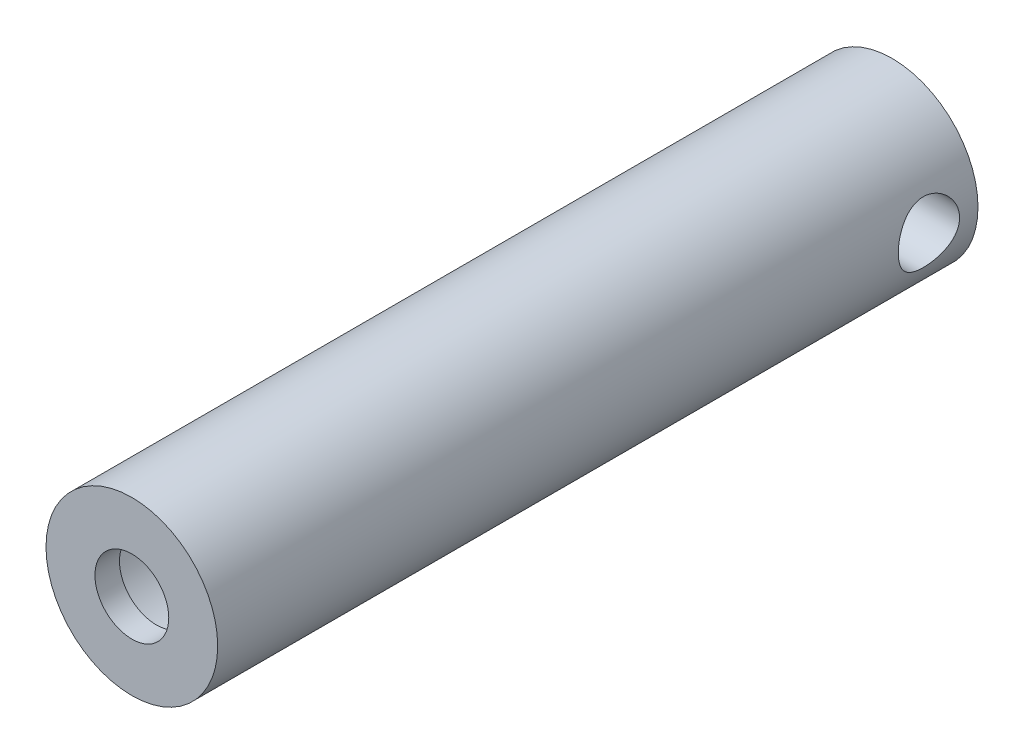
ISO-10303-21;
HEADER;
FILE_DESCRIPTION(('STEP AP214'),'2;1');
FILE_NAME('part.step','',(''),(''),'','','');
FILE_SCHEMA(('AUTOMOTIVE_DESIGN { 1 0 10303 214 1 1 1 1 }'));
ENDSEC;
DATA;
#1=APPLICATION_CONTEXT('core data for automotive mechanical design processes');
#2=APPLICATION_PROTOCOL_DEFINITION('international standard','automotive_design',2000,#1);
#3=PRODUCT_CONTEXT('',#1,'mechanical');
#4=PRODUCT('Part','Part','',(#3));
#5=PRODUCT_RELATED_PRODUCT_CATEGORY('part','',(#4));
#6=PRODUCT_DEFINITION_FORMATION('','',#4);
#7=PRODUCT_DEFINITION_CONTEXT('part definition',#1,'design');
#8=PRODUCT_DEFINITION('design','',#6,#7);
#9=PRODUCT_DEFINITION_SHAPE('','',#8);
#10=(LENGTH_UNIT() NAMED_UNIT(*) SI_UNIT(.MILLI.,.METRE.));
#11=(NAMED_UNIT(*) PLANE_ANGLE_UNIT() SI_UNIT($,.RADIAN.));
#12=(NAMED_UNIT(*) SI_UNIT($,.STERADIAN.) SOLID_ANGLE_UNIT());
#13=UNCERTAINTY_MEASURE_WITH_UNIT(LENGTH_MEASURE(1.E-05),#10,'distance_accuracy_value','');
#14=(GEOMETRIC_REPRESENTATION_CONTEXT(3) GLOBAL_UNCERTAINTY_ASSIGNED_CONTEXT((#13)) GLOBAL_UNIT_ASSIGNED_CONTEXT((#10,
#11,#12)) REPRESENTATION_CONTEXT('',''));
#15=CARTESIAN_POINT('',(0.,0.,0.));
#16=DIRECTION('',(0.,0.,1.));
#17=DIRECTION('',(1.,0.,0.));
#18=AXIS2_PLACEMENT_3D('',#15,#16,#17);
#19=CARTESIAN_POINT('',(0.,0.,50.));
#20=DIRECTION('',(0.,0.,-1.));
#21=DIRECTION('',(-1.,0.,0.));
#22=AXIS2_PLACEMENT_3D('',#19,#20,#21);
#23=CYLINDRICAL_SURFACE('',#22,35.);
#24=CARTESIAN_POINT('',(0.,-35.,22.75));
#25=CARTESIAN_POINT('',(-0.154213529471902,-34.9999985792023,22.7499932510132));
#26=CARTESIAN_POINT('',(-0.308532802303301,-34.9989699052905,22.7369844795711));
#27=CARTESIAN_POINT('',(-0.612903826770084,-34.9949652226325,22.6852802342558));
#28=CARTESIAN_POINT('',(-0.762950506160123,-34.9919869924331,22.6465554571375));
#29=CARTESIAN_POINT('',(-1.05432390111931,-34.9844198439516,22.5445440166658));
#30=CARTESIAN_POINT('',(-1.19565541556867,-34.97983182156,22.4812710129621));
#31=CARTESIAN_POINT('',(-1.46565723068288,-34.9695599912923,22.3319830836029));
#32=CARTESIAN_POINT('',(-1.59433027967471,-34.9638764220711,22.2459731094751));
#33=CARTESIAN_POINT('',(-1.83569091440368,-34.9520370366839,22.053440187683));
#34=CARTESIAN_POINT('',(-1.94834565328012,-34.9458802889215,21.9468761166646));
#35=CARTESIAN_POINT('',(-2.15419016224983,-34.9337962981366,21.7163464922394));
#36=CARTESIAN_POINT('',(-2.24737908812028,-34.9278690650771,21.5923801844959));
#37=CARTESIAN_POINT('',(-2.41175601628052,-34.9169049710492,21.3303685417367));
#38=CARTESIAN_POINT('',(-2.4829154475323,-34.9118692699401,21.1923052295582));
#39=CARTESIAN_POINT('',(-2.60103087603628,-34.9032687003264,20.9061441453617));
#40=CARTESIAN_POINT('',(-2.6479872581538,-34.8997038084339,20.7580465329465));
#41=CARTESIAN_POINT('',(-2.71626915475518,-34.894456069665,20.4563476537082));
#42=CARTESIAN_POINT('',(-2.73764781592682,-34.8927693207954,20.3027584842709));
#43=CARTESIAN_POINT('',(-2.75433156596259,-34.8914564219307,19.9941631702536));
#44=CARTESIAN_POINT('',(-2.7496370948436,-34.891830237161,19.8391570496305));
#45=CARTESIAN_POINT('',(-2.71435180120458,-34.8945926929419,19.5324915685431));
#46=CARTESIAN_POINT('',(-2.68381867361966,-34.8969768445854,19.3808255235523));
#47=CARTESIAN_POINT('',(-2.59781238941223,-34.9034842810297,19.0847777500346));
#48=CARTESIAN_POINT('',(-2.54233901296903,-34.9076075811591,18.9403960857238));
#49=CARTESIAN_POINT('',(-2.40796208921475,-34.917133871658,18.6628312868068));
#50=CARTESIAN_POINT('',(-2.32903258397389,-34.9225382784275,18.5296607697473));
#51=CARTESIAN_POINT('',(-2.15000265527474,-34.9340164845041,18.2784364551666));
#52=CARTESIAN_POINT('',(-2.0499018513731,-34.9400902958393,18.1603829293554));
#53=CARTESIAN_POINT('',(-1.83104688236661,-34.9522428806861,17.9424081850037));
#54=CARTESIAN_POINT('',(-1.71224282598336,-34.9583216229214,17.8425370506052));
#55=CARTESIAN_POINT('',(-1.45952803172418,-34.9697833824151,17.6641490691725));
#56=CARTESIAN_POINT('',(-1.32561728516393,-34.9751663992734,17.5856322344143));
#57=CARTESIAN_POINT('',(-1.04645833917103,-34.9846310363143,17.452185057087));
#58=CARTESIAN_POINT('',(-0.901209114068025,-34.9887125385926,17.3972568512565));
#59=CARTESIAN_POINT('',(-0.603510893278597,-34.9951128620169,17.3125807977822));
#60=CARTESIAN_POINT('',(-0.451062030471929,-34.9974317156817,17.2828324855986));
#61=CARTESIAN_POINT('',(-0.143726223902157,-35.0000412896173,17.2494232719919));
#62=CARTESIAN_POINT('',(0.0111531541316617,-35.0003373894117,17.2456931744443));
#63=CARTESIAN_POINT('',(0.319335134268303,-34.9988824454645,17.2642451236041));
#64=CARTESIAN_POINT('',(0.472637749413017,-34.9971314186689,17.2865269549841));
#65=CARTESIAN_POINT('',(0.773117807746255,-34.9917826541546,17.3564129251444));
#66=CARTESIAN_POINT('',(0.920302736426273,-34.9881872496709,17.4039850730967));
#67=CARTESIAN_POINT('',(1.20460104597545,-34.9795537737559,17.5230686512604));
#68=CARTESIAN_POINT('',(1.3417142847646,-34.9745156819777,17.594580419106));
#69=CARTESIAN_POINT('',(1.60229247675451,-34.9635485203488,17.7596877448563));
#70=CARTESIAN_POINT('',(1.72572824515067,-34.9576176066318,17.8533292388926));
#71=CARTESIAN_POINT('',(1.95515321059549,-34.9455376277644,18.0599713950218));
#72=CARTESIAN_POINT('',(2.06114213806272,-34.9393885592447,18.1729723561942));
#73=CARTESIAN_POINT('',(2.252901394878,-34.9275494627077,18.4154255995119));
#74=CARTESIAN_POINT('',(2.33862663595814,-34.9218604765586,18.5449136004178));
#75=CARTESIAN_POINT('',(2.48711613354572,-34.9116000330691,18.816487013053));
#76=CARTESIAN_POINT('',(2.54988059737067,-34.9070285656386,18.9585723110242));
#77=CARTESIAN_POINT('',(2.65058975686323,-34.8995263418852,19.2511461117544));
#78=CARTESIAN_POINT('',(2.68856225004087,-34.8965937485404,19.4016249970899));
#79=CARTESIAN_POINT('',(2.73870014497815,-34.892694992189,19.7068465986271));
#80=CARTESIAN_POINT('',(2.75086598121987,-34.8917287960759,19.8615892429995));
#81=CARTESIAN_POINT('',(2.74904043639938,-34.8918726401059,20.1704976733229));
#82=CARTESIAN_POINT('',(2.73511990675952,-34.8929770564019,20.3246638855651));
#83=CARTESIAN_POINT('',(2.68166431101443,-34.8971257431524,20.628461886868));
#84=CARTESIAN_POINT('',(2.64212920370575,-34.9001700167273,20.7780936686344));
#85=CARTESIAN_POINT('',(2.53858420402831,-34.9078539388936,21.0685813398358));
#86=CARTESIAN_POINT('',(2.47457536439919,-34.9124935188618,21.2094376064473));
#87=CARTESIAN_POINT('',(2.32390811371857,-34.9228453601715,21.4784158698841));
#88=CARTESIAN_POINT('',(2.23725011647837,-34.9285576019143,21.6065380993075));
#89=CARTESIAN_POINT('',(2.04347868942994,-34.9404295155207,21.8467735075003));
#90=CARTESIAN_POINT('',(1.93631298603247,-34.946590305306,21.9588444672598));
#91=CARTESIAN_POINT('',(1.70465914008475,-34.9586550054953,22.163451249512));
#92=CARTESIAN_POINT('',(1.58016680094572,-34.9645588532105,22.2559823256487));
#93=CARTESIAN_POINT('',(1.31717895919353,-34.9754539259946,22.4189922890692));
#94=CARTESIAN_POINT('',(1.17866000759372,-34.9804435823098,22.4894334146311));
#95=CARTESIAN_POINT('',(0.891817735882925,-34.9889291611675,22.6059686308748));
#96=CARTESIAN_POINT('',(0.743505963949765,-34.9924268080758,22.652090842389));
#97=CARTESIAN_POINT('',(0.495259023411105,-34.9966316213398,22.7068711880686));
#98=CARTESIAN_POINT('',(0.396922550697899,-34.9978890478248,22.7230231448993));
#99=CARTESIAN_POINT('',(0.19907207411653,-34.9995736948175,22.7445897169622));
#100=CARTESIAN_POINT('',(0.0995580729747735,-35.0000009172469,22.7500043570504));
#101=CARTESIAN_POINT('',(0.,-35.,22.75));
#102=B_SPLINE_CURVE_WITH_KNOTS('',3,(#24,#25,#26,#27,#28,#29,#30,#31,#32,#33,#34,#35,#36,#37,
#38,#39,#40,#41,#42,#43,#44,#45,#46,#47,#48,#49,#50,#51,#52,#53,#54,#55,#56,#57,#58,#59,#60,#61,
#62,#63,#64,#65,#66,#67,#68,#69,#70,#71,#72,#73,#74,#75,#76,#77,#78,#79,#80,#81,#82,#83,#84,#85,
#86,#87,#88,#89,#90,#91,#92,#93,#94,#95,#96,#97,#98,#99,#100,#101),.UNSPECIFIED.,.T.,.F.,(4,2,2,
2,2,2,2,2,2,2,2,2,2,2,2,2,2,2,2,2,2,2,2,2,2,2,2,2,2,2,2,2,2,2,2,2,2,2,4),(0.,0.462277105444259,
0.92508187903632,1.38762949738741,1.85007646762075,2.31345845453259,2.77686053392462,
3.24086112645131,3.70485434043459,4.16788176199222,4.6309013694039,5.09288982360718,
5.554882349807,6.01738806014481,6.47990208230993,6.94367145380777,7.40744109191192,
7.87125273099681,8.33505581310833,8.79762492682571,9.26019021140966,9.72217176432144,
10.1841598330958,10.6471154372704,11.1100781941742,11.5740615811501,12.0380407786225,
12.5014988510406,12.964949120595,13.4271424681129,13.889336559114,14.3515107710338,
14.8136765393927,15.2770364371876,15.7405087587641,16.2047690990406,16.6684914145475,
16.9669316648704,17.2653712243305),.UNSPECIFIED.);
#103=CARTESIAN_POINT('',(0.,-35.,22.75));
#104=VERTEX_POINT('',#103);
#105=EDGE_CURVE('E57',#104,#104,#102,.T.);
#106=ORIENTED_EDGE('',*,*,#105,.F.);
#107=EDGE_LOOP('',(#106));
#108=FACE_BOUND('',#107,.T.);
#109=CARTESIAN_POINT('',(-35.,0.,32.5));
#110=CARTESIAN_POINT('',(-35.0000006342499,-0.339590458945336,32.5000008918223));
#111=CARTESIAN_POINT('',(-34.9950467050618,-0.679167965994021,32.4861506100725));
#112=CARTESIAN_POINT('',(-34.9753685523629,-1.35577397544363,32.4308919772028));
#113=CARTESIAN_POINT('',(-34.9606448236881,-1.69280260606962,32.3894850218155));
#114=CARTESIAN_POINT('',(-34.9218277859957,-2.36182709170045,32.2795234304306));
#115=CARTESIAN_POINT('',(-34.8977349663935,-2.69382320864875,32.2109702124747));
#116=CARTESIAN_POINT('',(-34.8408248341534,-3.35045317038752,32.0473628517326));
#117=CARTESIAN_POINT('',(-34.8080073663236,-3.67508688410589,31.9523082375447));
#118=CARTESIAN_POINT('',(-34.7345800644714,-4.31418928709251,31.7367497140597));
#119=CARTESIAN_POINT('',(-34.6939849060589,-4.62867583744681,31.6162936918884));
#120=CARTESIAN_POINT('',(-34.6060051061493,-5.24610944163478,31.3508266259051));
#121=CARTESIAN_POINT('',(-34.5586205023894,-5.54905655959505,31.2058157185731));
#122=CARTESIAN_POINT('',(-34.4582529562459,-6.14158833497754,30.8923475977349));
#123=CARTESIAN_POINT('',(-34.4052699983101,-6.43117295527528,30.7238903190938));
#124=CARTESIAN_POINT('',(-34.2949948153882,-6.99542804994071,30.3646465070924));
#125=CARTESIAN_POINT('',(-34.2377009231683,-7.27009268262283,30.1738513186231));
#126=CARTESIAN_POINT('',(-34.1181762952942,-7.81215317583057,29.7642026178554));
#127=CARTESIAN_POINT('',(-34.0558431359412,-8.07896326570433,29.5446036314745));
#128=CARTESIAN_POINT('',(-33.9296805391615,-8.59342620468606,29.0841759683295));
#129=CARTESIAN_POINT('',(-33.8658504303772,-8.84107023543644,28.8433376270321));
#130=CARTESIAN_POINT('',(-33.7383843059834,-9.3156763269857,28.3419047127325));
#131=CARTESIAN_POINT('',(-33.6747483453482,-9.54263297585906,28.0813050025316));
#132=CARTESIAN_POINT('',(-33.5494227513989,-9.97430378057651,27.5420486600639));
#133=CARTESIAN_POINT('',(-33.4877322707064,-10.1790277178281,27.2634000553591));
#134=CARTESIAN_POINT('',(-33.3659068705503,-10.5716586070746,26.6796683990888));
#135=CARTESIAN_POINT('',(-33.3058985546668,-10.7587443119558,26.3740056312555));
#136=CARTESIAN_POINT('',(-33.1916181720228,-11.106302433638,25.7470393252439));
#137=CARTESIAN_POINT('',(-33.1373437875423,-11.266785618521,25.4257421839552));
#138=CARTESIAN_POINT('',(-33.0362462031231,-11.5598652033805,24.76955144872));
#139=CARTESIAN_POINT('',(-32.9894225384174,-11.6924633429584,24.4346587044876));
#140=CARTESIAN_POINT('',(-32.9047991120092,-11.9285347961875,23.7536528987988));
#141=CARTESIAN_POINT('',(-32.8669988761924,-12.0320096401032,23.4075404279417));
#142=CARTESIAN_POINT('',(-32.8029840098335,-12.2054275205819,22.7200061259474));
#143=CARTESIAN_POINT('',(-32.7763849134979,-12.2764918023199,22.3789028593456));
#144=CARTESIAN_POINT('',(-32.7336648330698,-12.3899506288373,21.6913081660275));
#145=CARTESIAN_POINT('',(-32.7175436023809,-12.4323458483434,21.3448168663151));
#146=CARTESIAN_POINT('',(-32.6963417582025,-12.487999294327,20.6492738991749));
#147=CARTESIAN_POINT('',(-32.6912576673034,-12.5012666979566,20.3002230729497));
#148=CARTESIAN_POINT('',(-32.6922992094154,-12.4985431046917,19.6022585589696));
#149=CARTESIAN_POINT('',(-32.6984244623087,-12.4825530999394,19.2533448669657));
#150=CARTESIAN_POINT('',(-32.7210431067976,-12.4231343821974,18.5770750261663));
#151=CARTESIAN_POINT('',(-32.7369636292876,-12.3812211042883,18.2495651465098));
#152=CARTESIAN_POINT('',(-32.7781529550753,-12.271760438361,17.5994709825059));
#153=CARTESIAN_POINT('',(-32.8034213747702,-12.2042141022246,17.2768864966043));
#154=CARTESIAN_POINT('',(-32.8625456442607,-12.0441007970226,16.6387709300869));
#155=CARTESIAN_POINT('',(-32.8964023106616,-11.9515314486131,16.3232405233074));
#156=CARTESIAN_POINT('',(-32.9717131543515,-11.742167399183,15.7012573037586));
#157=CARTESIAN_POINT('',(-33.0131675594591,-11.6253719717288,15.3948047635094));
#158=CARTESIAN_POINT('',(-33.1032939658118,-11.3662247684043,14.787531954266));
#159=CARTESIAN_POINT('',(-33.1520797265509,-11.2234609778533,14.4869045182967));
#160=CARTESIAN_POINT('',(-33.2549746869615,-10.9148118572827,13.8985840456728));
#161=CARTESIAN_POINT('',(-33.3090858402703,-10.7489180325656,13.6108958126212));
#162=CARTESIAN_POINT('',(-33.4211784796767,-10.3951549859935,13.0501321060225));
#163=CARTESIAN_POINT('',(-33.4791602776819,-10.2072839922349,12.7770578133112));
#164=CARTESIAN_POINT('',(-33.59750351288,-9.8107372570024,12.2470006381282));
#165=CARTESIAN_POINT('',(-33.6578650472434,-9.60206066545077,11.9900184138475));
#166=CARTESIAN_POINT('',(-33.7831643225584,-9.15181214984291,11.4784160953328));
#167=CARTESIAN_POINT('',(-33.8481571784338,-8.90901163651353,11.2248893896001));
#168=CARTESIAN_POINT('',(-33.977323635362,-8.40295394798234,10.7391507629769));
#169=CARTESIAN_POINT('',(-34.0414975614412,-8.13970520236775,10.5069301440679));
#170=CARTESIAN_POINT('',(-34.1673566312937,-7.59408676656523,10.0650542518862));
#171=CARTESIAN_POINT('',(-34.2290403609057,-7.31170644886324,9.85541169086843));
#172=CARTESIAN_POINT('',(-34.348189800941,-6.72978575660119,9.46037943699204));
#173=CARTESIAN_POINT('',(-34.4056572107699,-6.43025238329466,9.27497994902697));
#174=CARTESIAN_POINT('',(-34.5155541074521,-5.81175099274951,8.92746572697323));
#175=CARTESIAN_POINT('',(-34.56790751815,-5.49257940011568,8.76568877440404));
#176=CARTESIAN_POINT('',(-34.6652188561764,-4.84058141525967,8.46973814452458));
#177=CARTESIAN_POINT('',(-34.7101766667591,-4.50775480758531,8.33556490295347));
#178=CARTESIAN_POINT('',(-34.7913777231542,-3.83094638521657,8.09610756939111));
#179=CARTESIAN_POINT('',(-34.8276238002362,-3.48696823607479,7.99081409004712));
#180=CARTESIAN_POINT('',(-34.8903430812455,-2.79037944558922,7.81011762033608));
#181=CARTESIAN_POINT('',(-34.9168168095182,-2.43776926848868,7.73471302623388));
#182=CARTESIAN_POINT('',(-34.9581567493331,-1.74414077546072,7.61752970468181));
#183=CARTESIAN_POINT('',(-34.9735274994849,-1.40339938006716,7.5742862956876));
#184=CARTESIAN_POINT('',(-34.9942830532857,-0.71921373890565,7.5159864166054));
#185=CARTESIAN_POINT('',(-34.9996681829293,-0.375769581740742,7.50092902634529));
#186=CARTESIAN_POINT('',(-35.0003019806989,0.311139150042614,7.49915451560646));
#187=CARTESIAN_POINT('',(-34.9955524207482,0.654603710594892,7.51243244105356));
#188=CARTESIAN_POINT('',(-34.9760531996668,1.33898774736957,7.56718246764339));
#189=CARTESIAN_POINT('',(-34.9613036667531,1.67990725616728,7.60865420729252));
#190=CARTESIAN_POINT('',(-34.9228854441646,2.34504554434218,7.71747516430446));
#191=CARTESIAN_POINT('',(-34.8995393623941,2.66943652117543,7.7838899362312));
#192=CARTESIAN_POINT('',(-34.8445023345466,3.31125305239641,7.94202198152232));
#193=CARTESIAN_POINT('',(-34.8128116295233,3.62867880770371,8.03373852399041));
#194=CARTESIAN_POINT('',(-34.7418777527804,4.25454293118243,8.24170004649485));
#195=CARTESIAN_POINT('',(-34.7026339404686,4.56298053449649,8.35794710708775));
#196=CARTESIAN_POINT('',(-34.6175608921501,5.16895598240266,8.61403926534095));
#197=CARTESIAN_POINT('',(-34.5717314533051,5.46649349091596,8.75388508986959));
#198=CARTESIAN_POINT('',(-34.4732318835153,6.05709563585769,9.06037674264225));
#199=CARTESIAN_POINT('',(-34.4204061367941,6.34980172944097,9.2276633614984));
#200=CARTESIAN_POINT('',(-34.3102670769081,6.92026080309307,9.58494792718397));
#201=CARTESIAN_POINT('',(-34.2529520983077,7.19800816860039,9.77495431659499));
#202=CARTESIAN_POINT('',(-34.1352645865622,7.73691127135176,10.1764003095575));
#203=CARTESIAN_POINT('',(-34.0748917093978,7.99806513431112,10.3878423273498));
#204=CARTESIAN_POINT('',(-33.9525838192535,8.5023158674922,10.8308524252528));
#205=CARTESIAN_POINT('',(-33.8906487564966,8.74541216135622,11.0624211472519));
#206=CARTESIAN_POINT('',(-33.7634823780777,9.22452672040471,11.5570837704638));
#207=CARTESIAN_POINT('',(-33.6982496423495,9.45949398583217,11.8211965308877));
#208=CARTESIAN_POINT('',(-33.5696121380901,9.90632052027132,12.3685147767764));
#209=CARTESIAN_POINT('',(-33.5062065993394,10.1181896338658,12.6517120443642));
#210=CARTESIAN_POINT('',(-33.3829855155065,10.5176039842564,13.2357395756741));
#211=CARTESIAN_POINT('',(-33.323171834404,10.7051366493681,13.5365788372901));
#212=CARTESIAN_POINT('',(-33.2089834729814,11.0542822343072,14.1537627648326));
#213=CARTESIAN_POINT('',(-33.154606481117,11.2159061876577,14.4701007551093));
#214=CARTESIAN_POINT('',(-33.052892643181,11.5122054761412,15.1167853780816));
#215=CARTESIAN_POINT('',(-33.0055653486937,11.6468443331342,15.447150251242));
#216=CARTESIAN_POINT('',(-32.9195919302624,11.8876757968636,16.1192050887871));
#217=CARTESIAN_POINT('',(-32.8809458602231,11.9938682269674,16.4608951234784));
#218=CARTESIAN_POINT('',(-32.8136778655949,12.1767009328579,17.1529020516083));
#219=CARTESIAN_POINT('',(-32.7850513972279,12.2533546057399,17.5032149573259));
#220=CARTESIAN_POINT('',(-32.7388216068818,12.3763442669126,18.2098358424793));
#221=CARTESIAN_POINT('',(-32.7212176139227,12.4226821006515,18.5661434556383));
#222=CARTESIAN_POINT('',(-32.6983652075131,12.4827026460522,19.2607819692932));
#223=CARTESIAN_POINT('',(-32.6924521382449,12.4981426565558,19.5989402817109));
#224=CARTESIAN_POINT('',(-32.6911527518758,12.5015415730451,20.2754077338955));
#225=CARTESIAN_POINT('',(-32.6957660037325,12.4895016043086,20.6137168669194));
#226=CARTESIAN_POINT('',(-32.7153660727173,12.4380694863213,21.2879138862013));
#227=CARTESIAN_POINT('',(-32.730352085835,12.3986794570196,21.623801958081));
#228=CARTESIAN_POINT('',(-32.770208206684,12.2929507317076,22.2907093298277));
#229=CARTESIAN_POINT('',(-32.7950783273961,12.2266120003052,22.6217286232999));
#230=CARTESIAN_POINT('',(-32.8531695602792,12.0696336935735,23.2683067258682));
#231=CARTESIAN_POINT('',(-32.8861648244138,11.9796475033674,23.584044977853));
#232=CARTESIAN_POINT('',(-32.9598295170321,11.7754578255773,24.2066527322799));
#233=CARTESIAN_POINT('',(-33.0004987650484,11.6612549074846,24.5135224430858));
#234=CARTESIAN_POINT('',(-33.0883705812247,11.409535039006,25.1165684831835));
#235=CARTESIAN_POINT('',(-33.1355731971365,11.272017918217,25.4127447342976));
#236=CARTESIAN_POINT('',(-33.2352604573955,10.9746096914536,25.992848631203));
#237=CARTESIAN_POINT('',(-33.2877471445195,10.8147099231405,26.2767714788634));
#238=CARTESIAN_POINT('',(-33.399267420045,10.4653784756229,26.8441311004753));
#239=CARTESIAN_POINT('',(-33.4584948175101,10.2748930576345,27.1268812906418));
#240=CARTESIAN_POINT('',(-33.5796636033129,9.87170257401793,27.6756416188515));
#241=CARTESIAN_POINT('',(-33.6416062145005,9.65898743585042,27.9416440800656));
#242=CARTESIAN_POINT('',(-33.7665636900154,9.21264816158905,28.4553486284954));
#243=CARTESIAN_POINT('',(-33.8295788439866,8.9790183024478,28.7030456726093));
#244=CARTESIAN_POINT('',(-33.9550122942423,8.49236413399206,29.1785313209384));
#245=CARTESIAN_POINT('',(-34.0174308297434,8.23934799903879,29.4063282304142));
#246=CARTESIAN_POINT('',(-34.1430408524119,7.70274291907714,29.8511378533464));
#247=CARTESIAN_POINT('',(-34.2061270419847,7.41827115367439,30.0671169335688));
#248=CARTESIAN_POINT('',(-34.328149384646,6.8313939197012,30.4742327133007));
#249=CARTESIAN_POINT('',(-34.3870870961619,6.52899526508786,30.6653787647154));
#250=CARTESIAN_POINT('',(-34.4991956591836,5.90804812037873,31.0214825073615));
#251=CARTESIAN_POINT('',(-34.5523655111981,5.58949684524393,31.186435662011));
#252=CARTESIAN_POINT('',(-34.6514089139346,4.93844717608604,31.4887136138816));
#253=CARTESIAN_POINT('',(-34.6972825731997,4.60594898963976,31.626038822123));
#254=CARTESIAN_POINT('',(-34.7805759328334,3.92793519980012,31.8723190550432));
#255=CARTESIAN_POINT('',(-34.8179587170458,3.58237009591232,31.9811504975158));
#256=CARTESIAN_POINT('',(-34.8828959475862,2.88221488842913,32.1685729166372));
#257=CARTESIAN_POINT('',(-34.9104502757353,2.52762467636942,32.2471635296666));
#258=CARTESIAN_POINT('',(-34.9548780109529,1.81241029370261,32.3732364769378));
#259=CARTESIAN_POINT('',(-34.9717549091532,1.45178813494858,32.4207289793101));
#260=CARTESIAN_POINT('',(-34.9943152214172,0.727438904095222,32.4841092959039));
#261=CARTESIAN_POINT('',(-34.9999993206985,0.363712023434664,32.4999990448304));
#262=CARTESIAN_POINT('',(-35.,0.,32.5));
#263=B_SPLINE_CURVE_WITH_KNOTS('',3,(#109,#110,#111,#112,#113,#114,#115,#116,#117,#118,#119,
#120,#121,#122,#123,#124,#125,#126,#127,#128,#129,#130,#131,#132,#133,#134,#135,#136,#137,#138,
#139,#140,#141,#142,#143,#144,#145,#146,#147,#148,#149,#150,#151,#152,#153,#154,#155,#156,#157,
#158,#159,#160,#161,#162,#163,#164,#165,#166,#167,#168,#169,#170,#171,#172,#173,#174,#175,#176,
#177,#178,#179,#180,#181,#182,#183,#184,#185,#186,#187,#188,#189,#190,#191,#192,#193,#194,#195,
#196,#197,#198,#199,#200,#201,#202,#203,#204,#205,#206,#207,#208,#209,#210,#211,#212,#213,#214,
#215,#216,#217,#218,#219,#220,#221,#222,#223,#224,#225,#226,#227,#228,#229,#230,#231,#232,#233,
#234,#235,#236,#237,#238,#239,#240,#241,#242,#243,#244,#245,#246,#247,#248,#249,#250,#251,#252,
#253,#254,#255,#256,#257,#258,#259,#260,#261,#262),.UNSPECIFIED.,.T.,.F.,(4,2,2,2,2,2,2,2,2,2,2,
2,2,2,2,2,2,2,2,2,2,2,2,2,2,2,2,2,2,2,2,2,2,2,2,2,2,2,2,2,2,2,2,2,2,2,2,2,2,2,2,2,2,2,2,2,2,2,2,
2,2,2,2,2,2,2,2,2,2,2,2,2,2,2,2,2,4),(0.,1.01843211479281,2.03681265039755,3.05513999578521,
4.07348545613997,5.08992800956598,6.10636491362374,7.12280464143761,8.13963951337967,
9.19186746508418,10.2445767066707,11.2975605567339,12.3500792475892,13.4388209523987,
14.5271208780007,15.6153528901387,16.7035277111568,17.7505021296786,18.7974519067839,
19.8440717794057,20.8906561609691,21.8811873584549,22.8716779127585,23.8622626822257,
24.8528771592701,25.860852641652,26.8691992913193,27.8776272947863,28.8860965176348,
29.9558746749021,31.0252141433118,32.0951525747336,33.1646573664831,34.2482081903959,
35.3317761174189,36.4149914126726,37.4981485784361,38.5283110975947,39.5584399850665,
40.5883887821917,41.6183243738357,42.6130028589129,43.6076526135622,44.6023867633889,
45.5971515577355,46.6197713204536,47.6427722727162,48.6658885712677,49.6890375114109,
50.7661951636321,51.8428919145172,52.9201426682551,53.9969334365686,55.0751701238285,
56.1534135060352,57.2311672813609,58.3088554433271,59.3232789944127,60.3376610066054,
61.3519644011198,62.366269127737,63.3550546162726,64.3438168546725,65.3325863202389,
66.3217395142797,67.3586952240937,68.396122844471,69.4338352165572,70.4711124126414,
71.5578971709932,72.6442714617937,73.730833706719,74.8173797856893,75.9085631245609,
76.9997595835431,78.0905990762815,79.1813717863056),.UNSPECIFIED.);
#264=CARTESIAN_POINT('',(-35.,0.,32.5));
#265=VERTEX_POINT('',#264);
#266=EDGE_CURVE('E37',#265,#265,#263,.T.);
#267=ORIENTED_EDGE('',*,*,#266,.T.);
#268=EDGE_LOOP('',(#267));
#269=FACE_BOUND('',#268,.T.);
#270=CARTESIAN_POINT('',(35.,0.,7.5));
#271=CARTESIAN_POINT('',(35.0000006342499,-0.339590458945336,7.49999910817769));
#272=CARTESIAN_POINT('',(34.9950467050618,-0.679167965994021,7.51384938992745));
#273=CARTESIAN_POINT('',(34.9753685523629,-1.35577397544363,7.56910802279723));
#274=CARTESIAN_POINT('',(34.9606448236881,-1.69280260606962,7.61051497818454));
#275=CARTESIAN_POINT('',(34.9218277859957,-2.36182709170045,7.72047656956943));
#276=CARTESIAN_POINT('',(34.8977349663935,-2.69382320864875,7.78902978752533));
#277=CARTESIAN_POINT('',(34.8408248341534,-3.35045317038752,7.95263714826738));
#278=CARTESIAN_POINT('',(34.8080073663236,-3.67508688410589,8.04769176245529));
#279=CARTESIAN_POINT('',(34.7345800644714,-4.31418928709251,8.26325028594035));
#280=CARTESIAN_POINT('',(34.6939849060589,-4.62867583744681,8.38370630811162));
#281=CARTESIAN_POINT('',(34.6060051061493,-5.24610944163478,8.64917337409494));
#282=CARTESIAN_POINT('',(34.5586205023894,-5.54905655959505,8.79418428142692));
#283=CARTESIAN_POINT('',(34.4582529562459,-6.14158833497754,9.10765240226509));
#284=CARTESIAN_POINT('',(34.4052699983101,-6.43117295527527,9.27610968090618));
#285=CARTESIAN_POINT('',(34.2949948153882,-6.99542804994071,9.63535349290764));
#286=CARTESIAN_POINT('',(34.2377009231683,-7.27009268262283,9.82614868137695));
#287=CARTESIAN_POINT('',(34.1181762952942,-7.81215317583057,10.2357973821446));
#288=CARTESIAN_POINT('',(34.0558431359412,-8.07896326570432,10.4553963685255));
#289=CARTESIAN_POINT('',(33.9296805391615,-8.59342620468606,10.9158240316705));
#290=CARTESIAN_POINT('',(33.8658504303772,-8.84107023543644,11.1566623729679));
#291=CARTESIAN_POINT('',(33.7383843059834,-9.3156763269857,11.6580952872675));
#292=CARTESIAN_POINT('',(33.6747483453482,-9.54263297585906,11.9186949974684));
#293=CARTESIAN_POINT('',(33.5494227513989,-9.97430378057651,12.4579513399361));
#294=CARTESIAN_POINT('',(33.4877322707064,-10.1790277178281,12.7365999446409));
#295=CARTESIAN_POINT('',(33.3659068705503,-10.5716586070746,13.3203316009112));
#296=CARTESIAN_POINT('',(33.3058985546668,-10.7587443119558,13.6259943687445));
#297=CARTESIAN_POINT('',(33.1916181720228,-11.106302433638,14.2529606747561));
#298=CARTESIAN_POINT('',(33.1373437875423,-11.266785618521,14.5742578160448));
#299=CARTESIAN_POINT('',(33.0362462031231,-11.5598652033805,15.23044855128));
#300=CARTESIAN_POINT('',(32.9894225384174,-11.6924633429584,15.5653412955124));
#301=CARTESIAN_POINT('',(32.9047991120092,-11.9285347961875,16.2463471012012));
#302=CARTESIAN_POINT('',(32.8669988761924,-12.0320096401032,16.5924595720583));
#303=CARTESIAN_POINT('',(32.8029840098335,-12.2054275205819,17.2799938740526));
#304=CARTESIAN_POINT('',(32.7763849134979,-12.2764918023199,17.6210971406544));
#305=CARTESIAN_POINT('',(32.7336648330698,-12.3899506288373,18.3086918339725));
#306=CARTESIAN_POINT('',(32.7175436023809,-12.4323458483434,18.6551831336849));
#307=CARTESIAN_POINT('',(32.6963417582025,-12.487999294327,19.3507261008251));
#308=CARTESIAN_POINT('',(32.6912576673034,-12.5012666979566,19.6997769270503));
#309=CARTESIAN_POINT('',(32.6922992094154,-12.4985431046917,20.3977414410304));
#310=CARTESIAN_POINT('',(32.6984244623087,-12.4825530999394,20.7466551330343));
#311=CARTESIAN_POINT('',(32.7210431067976,-12.4231343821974,21.4229249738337));
#312=CARTESIAN_POINT('',(32.7369636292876,-12.3812211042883,21.7504348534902));
#313=CARTESIAN_POINT('',(32.7781529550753,-12.271760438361,22.4005290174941));
#314=CARTESIAN_POINT('',(32.8034213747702,-12.2042141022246,22.7231135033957));
#315=CARTESIAN_POINT('',(32.8625456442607,-12.0441007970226,23.3612290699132));
#316=CARTESIAN_POINT('',(32.8964023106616,-11.9515314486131,23.6767594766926));
#317=CARTESIAN_POINT('',(32.9717131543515,-11.742167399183,24.2987426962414));
#318=CARTESIAN_POINT('',(33.0131675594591,-11.6253719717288,24.6051952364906));
#319=CARTESIAN_POINT('',(33.1032939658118,-11.3662247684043,25.212468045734));
#320=CARTESIAN_POINT('',(33.1520797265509,-11.2234609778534,25.5130954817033));
#321=CARTESIAN_POINT('',(33.2549746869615,-10.9148118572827,26.1014159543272));
#322=CARTESIAN_POINT('',(33.3090858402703,-10.7489180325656,26.3891041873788));
#323=CARTESIAN_POINT('',(33.4211784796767,-10.3951549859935,26.9498678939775));
#324=CARTESIAN_POINT('',(33.4791602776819,-10.2072839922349,27.2229421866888));
#325=CARTESIAN_POINT('',(33.59750351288,-9.8107372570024,27.7529993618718));
#326=CARTESIAN_POINT('',(33.6578650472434,-9.60206066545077,28.0099815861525));
#327=CARTESIAN_POINT('',(33.7831643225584,-9.15181214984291,28.5215839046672));
#328=CARTESIAN_POINT('',(33.8481571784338,-8.90901163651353,28.7751106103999));
#329=CARTESIAN_POINT('',(33.977323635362,-8.40295394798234,29.2608492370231));
#330=CARTESIAN_POINT('',(34.0414975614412,-8.13970520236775,29.4930698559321));
#331=CARTESIAN_POINT('',(34.1673566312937,-7.59408676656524,29.9349457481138));
#332=CARTESIAN_POINT('',(34.2290403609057,-7.31170644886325,30.1445883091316));
#333=CARTESIAN_POINT('',(34.348189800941,-6.7297857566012,30.539620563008));
#334=CARTESIAN_POINT('',(34.4056572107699,-6.43025238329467,30.725020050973));
#335=CARTESIAN_POINT('',(34.5155541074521,-5.81175099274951,31.0725342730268));
#336=CARTESIAN_POINT('',(34.56790751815,-5.49257940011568,31.234311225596));
#337=CARTESIAN_POINT('',(34.6652188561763,-4.84058141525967,31.5302618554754));
#338=CARTESIAN_POINT('',(34.7101766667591,-4.50775480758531,31.6644350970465));
#339=CARTESIAN_POINT('',(34.7913777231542,-3.83094638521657,31.9038924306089));
#340=CARTESIAN_POINT('',(34.8276238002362,-3.48696823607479,32.0091859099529));
#341=CARTESIAN_POINT('',(34.8903430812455,-2.79037944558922,32.1898823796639));
#342=CARTESIAN_POINT('',(34.9168168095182,-2.43776926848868,32.2652869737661));
#343=CARTESIAN_POINT('',(34.9581567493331,-1.74414077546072,32.3824702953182));
#344=CARTESIAN_POINT('',(34.9735274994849,-1.40339938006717,32.4257137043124));
#345=CARTESIAN_POINT('',(34.9942830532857,-0.719213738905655,32.4840135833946));
#346=CARTESIAN_POINT('',(34.9996681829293,-0.375769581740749,32.4990709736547));
#347=CARTESIAN_POINT('',(35.0003019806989,0.311139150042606,32.5008454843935));
#348=CARTESIAN_POINT('',(34.9955524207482,0.654603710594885,32.4875675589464));
#349=CARTESIAN_POINT('',(34.9760531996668,1.33898774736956,32.4328175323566));
#350=CARTESIAN_POINT('',(34.9613036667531,1.67990725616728,32.3913457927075));
#351=CARTESIAN_POINT('',(34.9228854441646,2.34504554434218,32.2825248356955));
#352=CARTESIAN_POINT('',(34.8995393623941,2.66943652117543,32.2161100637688));
#353=CARTESIAN_POINT('',(34.8445023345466,3.31125305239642,32.0579780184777));
#354=CARTESIAN_POINT('',(34.8128116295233,3.62867880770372,31.9662614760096));
#355=CARTESIAN_POINT('',(34.7418777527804,4.25454293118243,31.7582999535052));
#356=CARTESIAN_POINT('',(34.7026339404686,4.5629805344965,31.6420528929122));
#357=CARTESIAN_POINT('',(34.6175608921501,5.16895598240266,31.385960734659));
#358=CARTESIAN_POINT('',(34.5717314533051,5.46649349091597,31.2461149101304));
#359=CARTESIAN_POINT('',(34.4732318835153,6.05709563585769,30.9396232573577));
#360=CARTESIAN_POINT('',(34.4204061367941,6.34980172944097,30.7723366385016));
#361=CARTESIAN_POINT('',(34.3102670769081,6.92026080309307,30.415052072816));
#362=CARTESIAN_POINT('',(34.2529520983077,7.19800816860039,30.225045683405));
#363=CARTESIAN_POINT('',(34.1352645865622,7.73691127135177,29.8235996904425));
#364=CARTESIAN_POINT('',(34.0748917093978,7.99806513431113,29.6121576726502));
#365=CARTESIAN_POINT('',(33.9525838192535,8.5023158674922,29.1691475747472));
#366=CARTESIAN_POINT('',(33.8906487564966,8.74541216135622,28.9375788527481));
#367=CARTESIAN_POINT('',(33.7634823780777,9.22452672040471,28.4429162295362));
#368=CARTESIAN_POINT('',(33.6982496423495,9.45949398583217,28.1788034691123));
#369=CARTESIAN_POINT('',(33.5696121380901,9.90632052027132,27.6314852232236));
#370=CARTESIAN_POINT('',(33.5062065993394,10.1181896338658,27.3482879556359));
#371=CARTESIAN_POINT('',(33.3829855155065,10.5176039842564,26.7642604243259));
#372=CARTESIAN_POINT('',(33.323171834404,10.7051366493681,26.4634211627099));
#373=CARTESIAN_POINT('',(33.2089834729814,11.0542822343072,25.8462372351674));
#374=CARTESIAN_POINT('',(33.154606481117,11.2159061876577,25.5298992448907));
#375=CARTESIAN_POINT('',(33.052892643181,11.5122054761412,24.8832146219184));
#376=CARTESIAN_POINT('',(33.0055653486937,11.6468443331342,24.552849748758));
#377=CARTESIAN_POINT('',(32.9195919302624,11.8876757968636,23.8807949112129));
#378=CARTESIAN_POINT('',(32.8809458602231,11.9938682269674,23.5391048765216));
#379=CARTESIAN_POINT('',(32.8136778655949,12.1767009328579,22.8470979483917));
#380=CARTESIAN_POINT('',(32.7850513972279,12.2533546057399,22.4967850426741));
#381=CARTESIAN_POINT('',(32.7388216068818,12.3763442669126,21.7901641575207));
#382=CARTESIAN_POINT('',(32.7212176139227,12.4226821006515,21.4338565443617));
#383=CARTESIAN_POINT('',(32.6983652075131,12.4827026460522,20.7392180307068));
#384=CARTESIAN_POINT('',(32.6924521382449,12.4981426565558,20.4010597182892));
#385=CARTESIAN_POINT('',(32.6911527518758,12.5015415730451,19.7245922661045));
#386=CARTESIAN_POINT('',(32.6957660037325,12.4895016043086,19.3862831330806));
#387=CARTESIAN_POINT('',(32.7153660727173,12.4380694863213,18.7120861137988));
#388=CARTESIAN_POINT('',(32.730352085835,12.3986794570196,18.376198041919));
#389=CARTESIAN_POINT('',(32.770208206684,12.2929507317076,17.7092906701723));
#390=CARTESIAN_POINT('',(32.7950783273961,12.2266120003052,17.3782713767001));
#391=CARTESIAN_POINT('',(32.8531695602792,12.0696336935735,16.7316932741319));
#392=CARTESIAN_POINT('',(32.8861648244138,11.9796475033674,16.4159550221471));
#393=CARTESIAN_POINT('',(32.959829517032,11.7754578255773,15.7933472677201));
#394=CARTESIAN_POINT('',(33.0004987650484,11.6612549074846,15.4864775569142));
#395=CARTESIAN_POINT('',(33.0883705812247,11.409535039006,14.8834315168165));
#396=CARTESIAN_POINT('',(33.1355731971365,11.272017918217,14.5872552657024));
#397=CARTESIAN_POINT('',(33.2352604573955,10.9746096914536,14.007151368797));
#398=CARTESIAN_POINT('',(33.2877471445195,10.8147099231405,13.7232285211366));
#399=CARTESIAN_POINT('',(33.399267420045,10.4653784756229,13.1558688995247));
#400=CARTESIAN_POINT('',(33.4584948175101,10.2748930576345,12.8731187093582));
#401=CARTESIAN_POINT('',(33.5796636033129,9.87170257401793,12.3243583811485));
#402=CARTESIAN_POINT('',(33.6416062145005,9.65898743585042,12.0583559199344));
#403=CARTESIAN_POINT('',(33.7665636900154,9.21264816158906,11.5446513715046));
#404=CARTESIAN_POINT('',(33.8295788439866,8.97901830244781,11.2969543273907));
#405=CARTESIAN_POINT('',(33.9550122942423,8.49236413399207,10.8214686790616));
#406=CARTESIAN_POINT('',(34.0174308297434,8.2393479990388,10.5936717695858));
#407=CARTESIAN_POINT('',(34.1430408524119,7.70274291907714,10.1488621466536));
#408=CARTESIAN_POINT('',(34.2061270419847,7.41827115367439,9.93288306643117));
#409=CARTESIAN_POINT('',(34.328149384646,6.8313939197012,9.52576728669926));
#410=CARTESIAN_POINT('',(34.3870870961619,6.52899526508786,9.33462123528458));
#411=CARTESIAN_POINT('',(34.4991956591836,5.90804812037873,8.97851749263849));
#412=CARTESIAN_POINT('',(34.5523655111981,5.58949684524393,8.81356433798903));
#413=CARTESIAN_POINT('',(34.6514089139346,4.93844717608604,8.51128638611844));
#414=CARTESIAN_POINT('',(34.6972825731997,4.60594898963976,8.37396117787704));
#415=CARTESIAN_POINT('',(34.7805759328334,3.92793519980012,8.12768094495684));
#416=CARTESIAN_POINT('',(34.8179587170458,3.58237009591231,8.0188495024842));
#417=CARTESIAN_POINT('',(34.8828959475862,2.88221488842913,7.8314270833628));
#418=CARTESIAN_POINT('',(34.9104502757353,2.52762467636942,7.75283647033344));
#419=CARTESIAN_POINT('',(34.9548780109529,1.8124102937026,7.62676352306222));
#420=CARTESIAN_POINT('',(34.9717549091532,1.45178813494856,7.57927102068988));
#421=CARTESIAN_POINT('',(34.9943152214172,0.727438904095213,7.51589070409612));
#422=CARTESIAN_POINT('',(34.9999993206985,0.36371202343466,7.50000095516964));
#423=CARTESIAN_POINT('',(35.,0.,7.5));
#424=B_SPLINE_CURVE_WITH_KNOTS('',3,(#270,#271,#272,#273,#274,#275,#276,#277,#278,#279,#280,
#281,#282,#283,#284,#285,#286,#287,#288,#289,#290,#291,#292,#293,#294,#295,#296,#297,#298,#299,
#300,#301,#302,#303,#304,#305,#306,#307,#308,#309,#310,#311,#312,#313,#314,#315,#316,#317,#318,
#319,#320,#321,#322,#323,#324,#325,#326,#327,#328,#329,#330,#331,#332,#333,#334,#335,#336,#337,
#338,#339,#340,#341,#342,#343,#344,#345,#346,#347,#348,#349,#350,#351,#352,#353,#354,#355,#356,
#357,#358,#359,#360,#361,#362,#363,#364,#365,#366,#367,#368,#369,#370,#371,#372,#373,#374,#375,
#376,#377,#378,#379,#380,#381,#382,#383,#384,#385,#386,#387,#388,#389,#390,#391,#392,#393,#394,
#395,#396,#397,#398,#399,#400,#401,#402,#403,#404,#405,#406,#407,#408,#409,#410,#411,#412,#413,
#414,#415,#416,#417,#418,#419,#420,#421,#422,#423),.UNSPECIFIED.,.T.,.F.,(4,2,2,2,2,2,2,2,2,2,2,
2,2,2,2,2,2,2,2,2,2,2,2,2,2,2,2,2,2,2,2,2,2,2,2,2,2,2,2,2,2,2,2,2,2,2,2,2,2,2,2,2,2,2,2,2,2,2,2,
2,2,2,2,2,2,2,2,2,2,2,2,2,2,2,2,2,4),(0.,1.01843211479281,2.03681265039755,3.05513999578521,
4.07348545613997,5.08992800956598,6.10636491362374,7.12280464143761,8.13963951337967,
9.19186746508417,10.2445767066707,11.2975605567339,12.3500792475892,13.4388209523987,
14.5271208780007,15.6153528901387,16.7035277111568,17.7505021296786,18.7974519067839,
19.8440717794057,20.8906561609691,21.8811873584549,22.8716779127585,23.8622626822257,
24.8528771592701,25.860852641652,26.8691992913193,27.8776272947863,28.8860965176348,
29.955874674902,31.0252141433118,32.0951525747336,33.1646573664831,34.2482081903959,
35.3317761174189,36.4149914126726,37.4981485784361,38.5283110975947,39.5584399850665,
40.5883887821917,41.6183243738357,42.6130028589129,43.6076526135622,44.602386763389,
45.5971515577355,46.6197713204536,47.6427722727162,48.6658885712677,49.6890375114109,
50.7661951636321,51.8428919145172,52.9201426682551,53.9969334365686,55.0751701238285,
56.1534135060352,57.2311672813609,58.3088554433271,59.3232789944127,60.3376610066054,
61.3519644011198,62.366269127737,63.3550546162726,64.3438168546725,65.3325863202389,
66.3217395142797,67.3586952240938,68.3961228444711,69.4338352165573,70.4711124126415,
71.5578971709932,72.6442714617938,73.730833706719,74.8173797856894,75.9085631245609,
76.9997595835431,78.0905990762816,79.1813717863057),.UNSPECIFIED.);
#425=CARTESIAN_POINT('',(35.,0.,7.5));
#426=VERTEX_POINT('',#425);
#427=EDGE_CURVE('E52',#426,#426,#424,.T.);
#428=ORIENTED_EDGE('',*,*,#427,.T.);
#429=EDGE_LOOP('',(#428));
#430=FACE_BOUND('',#429,.T.);
#431=CARTESIAN_POINT('',(0.,0.,0.));
#432=DIRECTION('',(0.,0.,1.));
#433=DIRECTION('',(1.,0.,0.));
#434=AXIS2_PLACEMENT_3D('',#431,#432,#433);
#435=CIRCLE('',#434,35.);
#436=CARTESIAN_POINT('',(35.,0.,0.));
#437=VERTEX_POINT('',#436);
#438=EDGE_CURVE('E44',#437,#437,#435,.T.);
#439=ORIENTED_EDGE('',*,*,#438,.T.);
#440=EDGE_LOOP('',(#439));
#441=FACE_BOUND('',#440,.T.);
#442=CARTESIAN_POINT('',(0.,0.,310.));
#443=DIRECTION('',(0.,0.,1.));
#444=DIRECTION('',(1.,0.,0.));
#445=AXIS2_PLACEMENT_3D('',#442,#443,#444);
#446=CIRCLE('',#445,35.);
#447=CARTESIAN_POINT('',(35.,0.,310.));
#448=VERTEX_POINT('',#447);
#449=EDGE_CURVE('E108',#448,#448,#446,.T.);
#450=ORIENTED_EDGE('',*,*,#449,.F.);
#451=EDGE_LOOP('',(#450));
#452=FACE_BOUND('',#451,.T.);
#453=ADVANCED_FACE('F33',(#108,#269,#430,#441,#452),#23,.T.);
#454=CARTESIAN_POINT('',(0.,0.,0.));
#455=DIRECTION('',(0.,0.,1.));
#456=DIRECTION('',(1.,0.,0.));
#457=AXIS2_PLACEMENT_3D('',#454,#455,#456);
#458=PLANE('',#457);
#459=ORIENTED_EDGE('',*,*,#438,.F.);
#460=EDGE_LOOP('',(#459));
#461=FACE_BOUND('',#460,.T.);
#462=ADVANCED_FACE('F81',(#461),#458,.F.);
#463=CARTESIAN_POINT('',(0.,0.,310.));
#464=DIRECTION('',(0.,0.,1.));
#465=DIRECTION('',(1.,0.,0.));
#466=AXIS2_PLACEMENT_3D('',#463,#464,#465);
#467=PLANE('',#466);
#468=ORIENTED_EDGE('',*,*,#449,.T.);
#469=EDGE_LOOP('',(#468));
#470=FACE_BOUND('',#469,.T.);
#471=CARTESIAN_POINT('',(0.,0.,310.));
#472=DIRECTION('',(0.,0.,1.));
#473=DIRECTION('',(1.,0.,0.));
#474=AXIS2_PLACEMENT_3D('',#471,#472,#473);
#475=CIRCLE('',#474,15.05);
#476=CARTESIAN_POINT('',(15.05,0.,310.));
#477=VERTEX_POINT('',#476);
#478=EDGE_CURVE('E110',#477,#477,#475,.T.);
#479=ORIENTED_EDGE('',*,*,#478,.F.);
#480=EDGE_LOOP('',(#479));
#481=FACE_BOUND('',#480,.T.);
#482=ADVANCED_FACE('F77',(#470,#481),#467,.T.);
#483=CARTESIAN_POINT('',(0.,0.,300.));
#484=DIRECTION('',(0.,0.,1.));
#485=DIRECTION('',(1.,0.,0.));
#486=AXIS2_PLACEMENT_3D('',#483,#484,#485);
#487=PLANE('',#486);
#488=CARTESIAN_POINT('',(0.,0.,300.));
#489=DIRECTION('',(0.,0.,1.));
#490=DIRECTION('',(1.,0.,0.));
#491=AXIS2_PLACEMENT_3D('',#488,#489,#490);
#492=CIRCLE('',#491,30.);
#493=CARTESIAN_POINT('',(30.,0.,300.));
#494=VERTEX_POINT('',#493);
#495=EDGE_CURVE('E49',#494,#494,#492,.T.);
#496=ORIENTED_EDGE('',*,*,#495,.F.);
#497=EDGE_LOOP('',(#496));
#498=FACE_BOUND('',#497,.T.);
#499=CARTESIAN_POINT('',(0.,0.,300.));
#500=DIRECTION('',(0.,0.,1.));
#501=DIRECTION('',(1.,0.,0.));
#502=AXIS2_PLACEMENT_3D('',#499,#500,#501);
#503=CIRCLE('',#502,15.05);
#504=CARTESIAN_POINT('',(15.05,0.,300.));
#505=VERTEX_POINT('',#504);
#506=EDGE_CURVE('E118',#505,#505,#503,.T.);
#507=ORIENTED_EDGE('',*,*,#506,.T.);
#508=EDGE_LOOP('',(#507));
#509=FACE_BOUND('',#508,.T.);
#510=ADVANCED_FACE('F73',(#498,#509),#487,.F.);
#511=CARTESIAN_POINT('',(0.,0.,310.));
#512=DIRECTION('',(0.,0.,-1.));
#513=DIRECTION('',(-1.,0.,0.));
#514=AXIS2_PLACEMENT_3D('',#511,#512,#513);
#515=CYLINDRICAL_SURFACE('',#514,15.05);
#516=ORIENTED_EDGE('',*,*,#478,.T.);
#517=EDGE_LOOP('',(#516));
#518=FACE_BOUND('',#517,.T.);
#519=ORIENTED_EDGE('',*,*,#506,.F.);
#520=EDGE_LOOP('',(#519));
#521=FACE_BOUND('',#520,.T.);
#522=ADVANCED_FACE('F68',(#518,#521),#515,.F.);
#523=CARTESIAN_POINT('',(0.,0.,50.));
#524=DIRECTION('',(0.,0.,1.));
#525=DIRECTION('',(1.,0.,0.));
#526=AXIS2_PLACEMENT_3D('',#523,#524,#525);
#527=PLANE('',#526);
#528=CARTESIAN_POINT('',(0.,0.,50.));
#529=DIRECTION('',(0.,0.,1.));
#530=DIRECTION('',(1.,0.,0.));
#531=AXIS2_PLACEMENT_3D('',#528,#529,#530);
#532=CIRCLE('',#531,30.);
#533=CARTESIAN_POINT('',(30.,0.,50.));
#534=VERTEX_POINT('',#533);
#535=EDGE_CURVE('E10',#534,#534,#532,.F.);
#536=ORIENTED_EDGE('',*,*,#535,.F.);
#537=EDGE_LOOP('',(#536));
#538=FACE_BOUND('',#537,.T.);
#539=ADVANCED_FACE('F72',(#538),#527,.T.);
#540=CARTESIAN_POINT('',(0.,0.,300.));
#541=DIRECTION('',(0.,0.,-1.));
#542=DIRECTION('',(-1.,0.,0.));
#543=AXIS2_PLACEMENT_3D('',#540,#541,#542);
#544=CYLINDRICAL_SURFACE('',#543,30.);
#545=ORIENTED_EDGE('',*,*,#495,.T.);
#546=EDGE_LOOP('',(#545));
#547=FACE_BOUND('',#546,.T.);
#548=ORIENTED_EDGE('',*,*,#535,.T.);
#549=EDGE_LOOP('',(#548));
#550=FACE_BOUND('',#549,.T.);
#551=ADVANCED_FACE('F64',(#547,#550),#544,.F.);
#552=CARTESIAN_POINT('',(-43.,0.,20.));
#553=DIRECTION('',(1.,0.,0.));
#554=DIRECTION('',(0.,0.,-1.));
#555=AXIS2_PLACEMENT_3D('',#552,#553,#554);
#556=CYLINDRICAL_SURFACE('',#555,12.5);
#557=CARTESIAN_POINT('',(0.,-12.1937483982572,22.75));
#558=CARTESIAN_POINT('',(0.152449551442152,-12.1937514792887,22.7499947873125));
#559=CARTESIAN_POINT('',(0.304961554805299,-12.1966384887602,22.7372800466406));
#560=CARTESIAN_POINT('',(0.605646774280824,-12.2078530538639,22.6868136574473));
#561=CARTESIAN_POINT('',(0.753816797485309,-12.2161845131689,22.6490440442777));
#562=CARTESIAN_POINT('',(1.04142504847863,-12.2372997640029,22.549716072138));
#563=CARTESIAN_POINT('',(1.18087272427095,-12.2500786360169,22.4881839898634));
#564=CARTESIAN_POINT('',(1.44746924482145,-12.2786429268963,22.3431531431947));
#565=CARTESIAN_POINT('',(1.57461831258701,-12.2944282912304,22.2596547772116));
#566=CARTESIAN_POINT('',(1.81518290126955,-12.3275283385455,22.0715405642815));
#567=CARTESIAN_POINT('',(1.92835764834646,-12.34486277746,21.9666202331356));
#568=CARTESIAN_POINT('',(2.13565179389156,-12.3789349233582,21.7392976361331));
#569=CARTESIAN_POINT('',(2.22976970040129,-12.3956725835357,21.6168940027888));
#570=CARTESIAN_POINT('',(2.39723216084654,-12.4268805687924,21.3564637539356));
#571=CARTESIAN_POINT('',(2.47034494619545,-12.4413248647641,21.2182847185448));
#572=CARTESIAN_POINT('',(2.59222200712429,-12.4660953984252,20.93123053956));
#573=CARTESIAN_POINT('',(2.64098904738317,-12.4764221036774,20.7823566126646));
#574=CARTESIAN_POINT('',(2.71203249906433,-12.4916543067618,20.4806423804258));
#575=CARTESIAN_POINT('',(2.73471646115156,-12.4966431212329,20.327902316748));
#576=CARTESIAN_POINT('',(2.75422427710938,-12.5009261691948,20.0207086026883));
#577=CARTESIAN_POINT('',(2.75105112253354,-12.5002210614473,19.8662551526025));
#578=CARTESIAN_POINT('',(2.7192379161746,-12.4932593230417,19.5628292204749));
#579=CARTESIAN_POINT('',(2.69103717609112,-12.4870984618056,19.4138081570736));
#580=CARTESIAN_POINT('',(2.61066960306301,-12.4700266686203,19.1226669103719));
#581=CARTESIAN_POINT('',(2.55850167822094,-12.4591155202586,18.9805470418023));
#582=CARTESIAN_POINT('',(2.43129328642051,-12.4336154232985,18.7060253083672));
#583=CARTESIAN_POINT('',(2.35608668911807,-12.4189998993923,18.5737029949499));
#584=CARTESIAN_POINT('',(2.1850597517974,-12.3876929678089,18.3233969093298));
#585=CARTESIAN_POINT('',(2.08923657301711,-12.3710012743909,18.2054151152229));
#586=CARTESIAN_POINT('',(1.87730619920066,-12.336962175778,17.9845260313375));
#587=CARTESIAN_POINT('',(1.76081453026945,-12.3196083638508,17.8819882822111));
#588=CARTESIAN_POINT('',(1.51210957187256,-12.286529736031,17.6978343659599));
#589=CARTESIAN_POINT('',(1.37989584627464,-12.270804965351,17.6162187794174));
#590=CARTESIAN_POINT('',(1.10289752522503,-12.2427476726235,17.476059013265));
#591=CARTESIAN_POINT('',(0.958076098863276,-12.230425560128,17.4175853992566));
#592=CARTESIAN_POINT('',(0.660327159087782,-12.2107124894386,17.3259166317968));
#593=CARTESIAN_POINT('',(0.507400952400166,-12.2033207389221,17.2927174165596));
#594=CARTESIAN_POINT('',(0.201162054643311,-12.1944670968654,17.2531145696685));
#595=CARTESIAN_POINT('',(0.0479223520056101,-12.1928860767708,17.2461725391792));
#596=CARTESIAN_POINT('',(-0.25752480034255,-12.1955114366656,17.2578228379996));
#597=CARTESIAN_POINT('',(-0.40973232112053,-12.1997174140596,17.2764133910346));
#598=CARTESIAN_POINT('',(-0.706915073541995,-12.2133303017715,17.338133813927));
#599=CARTESIAN_POINT('',(-0.851955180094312,-12.2226741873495,17.3809664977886));
#600=CARTESIAN_POINT('',(-1.13279996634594,-12.2454531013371,17.4896332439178));
#601=CARTESIAN_POINT('',(-1.26860375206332,-12.2588885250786,17.5554695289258));
#602=CARTESIAN_POINT('',(-1.52944899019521,-12.2885979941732,17.7094585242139));
#603=CARTESIAN_POINT('',(-1.65429011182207,-12.3049129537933,17.797942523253));
#604=CARTESIAN_POINT('',(-1.88754951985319,-12.338435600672,17.9942822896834));
#605=CARTESIAN_POINT('',(-1.9959657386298,-12.355643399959,18.1021404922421));
#606=CARTESIAN_POINT('',(-2.1953910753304,-12.389405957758,18.3366046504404));
#607=CARTESIAN_POINT('',(-2.28603291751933,-12.4059422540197,18.4635261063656));
#608=CARTESIAN_POINT('',(-2.44470850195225,-12.4361573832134,18.7311066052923));
#609=CARTESIAN_POINT('',(-2.51274330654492,-12.4498363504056,18.8717650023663));
#610=CARTESIAN_POINT('',(-2.62376381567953,-12.4727178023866,19.1619451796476));
#611=CARTESIAN_POINT('',(-2.66690923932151,-12.4819487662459,19.311403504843));
#612=CARTESIAN_POINT('',(-2.72742440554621,-12.49501733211,19.6156731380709));
#613=CARTESIAN_POINT('',(-2.74479794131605,-12.4988557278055,19.7704836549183));
#614=CARTESIAN_POINT('',(-2.7531039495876,-12.5006827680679,20.0775779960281));
#615=CARTESIAN_POINT('',(-2.74458452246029,-12.4987926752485,20.2298465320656));
#616=CARTESIAN_POINT('',(-2.70257355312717,-12.4896352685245,20.530724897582));
#617=CARTESIAN_POINT('',(-2.6690824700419,-12.4823680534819,20.6793347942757));
#618=CARTESIAN_POINT('',(-2.57834282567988,-12.46328231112,20.9682476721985));
#619=CARTESIAN_POINT('',(-2.52117283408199,-12.451478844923,21.1085763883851));
#620=CARTESIAN_POINT('',(-2.38477450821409,-12.4245803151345,21.3777222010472));
#621=CARTESIAN_POINT('',(-2.30554400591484,-12.4094849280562,21.5065381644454));
#622=CARTESIAN_POINT('',(-2.12549095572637,-12.3772871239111,21.7516726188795));
#623=CARTESIAN_POINT('',(-2.02428347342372,-12.3601517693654,21.8677040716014));
#624=CARTESIAN_POINT('',(-1.80392471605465,-12.3259815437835,22.0813239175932));
#625=CARTESIAN_POINT('',(-1.6847691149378,-12.3089466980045,22.1789078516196));
#626=CARTESIAN_POINT('',(-1.42995294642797,-12.2766484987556,22.354138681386));
#627=CARTESIAN_POINT('',(-1.29409045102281,-12.2614123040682,22.4314972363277));
#628=CARTESIAN_POINT('',(-1.01098646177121,-12.2347788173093,22.5621607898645));
#629=CARTESIAN_POINT('',(-0.863754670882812,-12.2233782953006,22.6154860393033));
#630=CARTESIAN_POINT('',(-0.596989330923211,-12.2078025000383,22.6871085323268));
#631=CARTESIAN_POINT('',(-0.47889699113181,-12.202567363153,22.7106473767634));
#632=CARTESIAN_POINT('',(-0.240549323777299,-12.1955391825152,22.7420947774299));
#633=CARTESIAN_POINT('',(-0.120294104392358,-12.1937459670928,22.7500041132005));
#634=CARTESIAN_POINT('',(0.,-12.1937483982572,22.75));
#635=B_SPLINE_CURVE_WITH_KNOTS('',3,(#557,#558,#559,#560,#561,#562,#563,#564,#565,#566,#567,
#568,#569,#570,#571,#572,#573,#574,#575,#576,#577,#578,#579,#580,#581,#582,#583,#584,#585,#586,
#587,#588,#589,#590,#591,#592,#593,#594,#595,#596,#597,#598,#599,#600,#601,#602,#603,#604,#605,
#606,#607,#608,#609,#610,#611,#612,#613,#614,#615,#616,#617,#618,#619,#620,#621,#622,#623,#624,
#625,#626,#627,#628,#629,#630,#631,#632,#633,#634),.UNSPECIFIED.,.T.,.F.,(4,2,2,2,2,2,2,2,2,2,2,
2,2,2,2,2,2,2,2,2,2,2,2,2,2,2,2,2,2,2,2,2,2,2,2,2,2,2,4),(0.,0.456907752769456,
0.914143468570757,1.3708750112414,1.82759827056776,2.29133235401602,2.75510272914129,
3.22380935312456,3.69246273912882,4.15368936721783,4.61486263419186,5.06809754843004,
5.52135311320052,5.97795723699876,6.43462427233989,6.90090287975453,7.36719442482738,
7.83489705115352,8.30252449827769,8.76050965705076,9.21846295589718,9.67092013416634,
10.1234210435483,10.5829625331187,11.0425618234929,11.5108380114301,11.9790921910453,
12.4443070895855,12.9094535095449,13.3648228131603,13.8201837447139,14.274045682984,
14.7279522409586,15.190563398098,15.6532862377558,16.1222846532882,16.5908871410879,
16.9514395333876,17.3119739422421),.UNSPECIFIED.);
#636=CARTESIAN_POINT('',(0.,-12.1937483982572,22.75));
#637=VERTEX_POINT('',#636);
#638=EDGE_CURVE('E127',#637,#637,#635,.T.);
#639=ORIENTED_EDGE('',*,*,#638,.F.);
#640=EDGE_LOOP('',(#639));
#641=FACE_BOUND('',#640,.T.);
#642=ORIENTED_EDGE('',*,*,#427,.F.);
#643=EDGE_LOOP('',(#642));
#644=FACE_BOUND('',#643,.T.);
#645=ORIENTED_EDGE('',*,*,#266,.F.);
#646=EDGE_LOOP('',(#645));
#647=FACE_BOUND('',#646,.T.);
#648=ADVANCED_FACE('F58',(#641,#644,#647),#556,.F.);
#649=CARTESIAN_POINT('',(0.,-35.001,20.));
#650=DIRECTION('',(0.,1.,0.));
#651=DIRECTION('',(0.,0.,1.));
#652=AXIS2_PLACEMENT_3D('',#649,#650,#651);
#653=CYLINDRICAL_SURFACE('',#652,2.75);
#654=ORIENTED_EDGE('',*,*,#638,.T.);
#655=EDGE_LOOP('',(#654));
#656=FACE_BOUND('',#655,.T.);
#657=ORIENTED_EDGE('',*,*,#105,.T.);
#658=EDGE_LOOP('',(#657));
#659=FACE_BOUND('',#658,.T.);
#660=ADVANCED_FACE('F63',(#656,#659),#653,.F.);
#661=CLOSED_SHELL('',(#453,#462,#482,#510,#522,#539,#551,#648,#660));
#662=MANIFOLD_SOLID_BREP('B2',#661);
#663=ADVANCED_BREP_SHAPE_REPRESENTATION('',(#18,#662),#14);
#664=SHAPE_DEFINITION_REPRESENTATION(#9,#663);
ENDSEC;
END-ISO-10303-21;
